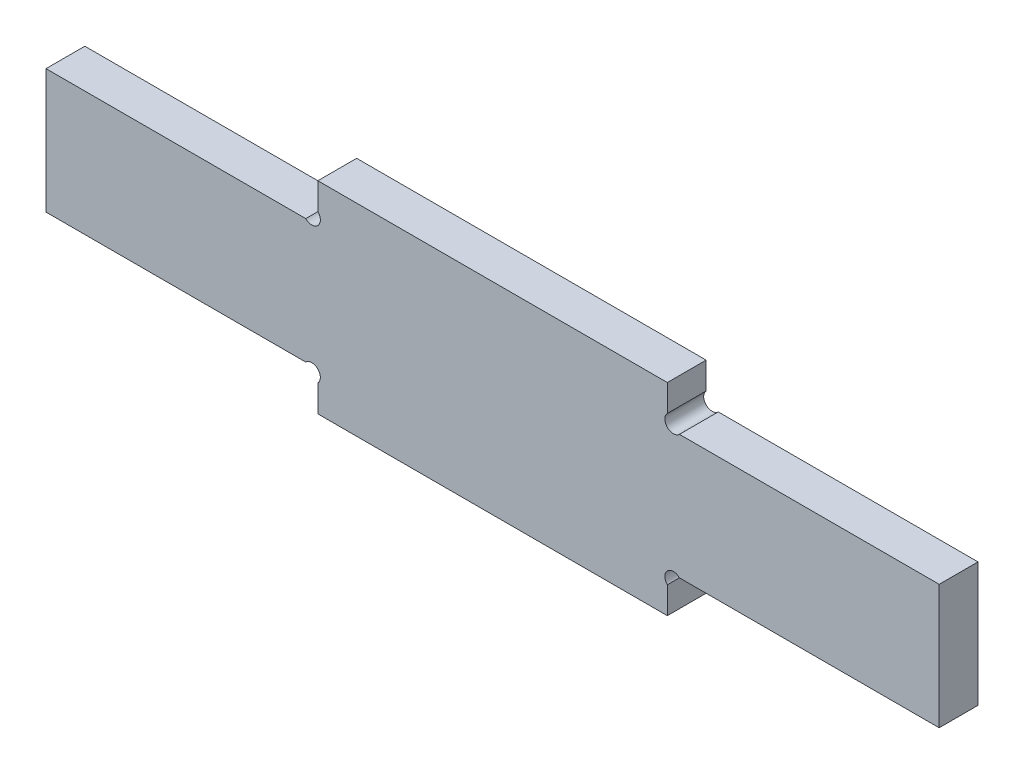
from build123d import *

# Parameters (mm, degrees)
ESQUISSE1_W             = 57.5
ESQUISSE1_H             = 26
BOSS_EXTRU_1_DEPTH      = 5
ENL_V_MAT_EXTRU_1_REACH = 65.303
ESQUISSE3_W             = 35
ESQUISSE3_H             = 5
ENL_V_START             = -5
ESQUISSE4_R             = 1.1
ENL_V_MAT_EXTRU_2_DEPTH = 5


with BuildPart() as part:
    # Esquisse1 → Boss.-Extru.1 (new body)
    with BuildSketch(Plane.XY):
        with Locations((28.75, 13)):
            Rectangle(ESQUISSE1_W, ESQUISSE1_H)
    boss_extru_1 = extrude(amount=BOSS_EXTRU_1_DEPTH)

    # Esquisse3 → Enl_v. mat.-Extru.1 (cut, up to next)
    with BuildSketch(Plane.XY.offset(5), mode=Mode.PRIVATE) as enl_v_mat_extru_1_sk1:
        with Locations((17.5, 23.5)):
            Rectangle(ESQUISSE3_W, ESQUISSE3_H)
    enl_v_mat_extru_1_tool1 = extrude(enl_v_mat_extru_1_sk1.sketch, amount=-ENL_V_MAT_EXTRU_1_REACH, mode=Mode.PRIVATE) & part.part
    # Esquisse3 → Enl_v. mat.-Extru.1 (cut, up to next)
    with BuildSketch(Plane.XY.offset(5), mode=Mode.PRIVATE) as enl_v_mat_extru_1_sk2:
        with Locations((17.5, 2.5)):
            Rectangle(ESQUISSE3_W, ESQUISSE3_H)
    enl_v_mat_extru_1_tool2 = extrude(enl_v_mat_extru_1_sk2.sketch, amount=-ENL_V_MAT_EXTRU_1_REACH, mode=Mode.PRIVATE) & part.part
    enl_v_mat_extru_1_1 = enl_v_mat_extru_1_tool1.solids().sort_by_distance((17.5, 23.5, 5))[0]
    add(enl_v_mat_extru_1_1, mode=Mode.SUBTRACT)
    enl_v_mat_extru_1_2 = enl_v_mat_extru_1_tool2.solids().sort_by_distance((17.5, 2.5, 5))[0]
    add(enl_v_mat_extru_1_2, mode=Mode.SUBTRACT)
    enl_v_mat_extru_1 = enl_v_mat_extru_1_1 + enl_v_mat_extru_1_2  # Enl_v. mat.-Extru.1 as one shape, for the pattern or mirror that repeats it

    # Esquisse4 → Enl_v. mat.-Extru.2 (cut)
    with BuildSketch(Plane.XY.offset(5).offset(ENL_V_START)):
        with Locations((34.222182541, 21.777817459)):
            Circle(ESQUISSE4_R)
        with Locations((34.222182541, 4.222182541)):
            Circle(ESQUISSE4_R)
    enl_v_mat_extru_2 = extrude(amount=ENL_V_MAT_EXTRU_2_DEPTH, mode=Mode.SUBTRACT)

    # Sym_trie1: Boss.-Extru.1, Enl_v. mat.-Extru.1, Enl_v. mat.-Extru.2 across plane
    add(boss_extru_1.mirror(Plane(origin=(57.5, 0, 5), x_dir=(0, 0, 1), z_dir=(-1, 0, 0))))
    add(enl_v_mat_extru_1.mirror(Plane(origin=(57.5, 0, 5), x_dir=(0, 0, 1), z_dir=(-1, 0, 0))), mode=Mode.SUBTRACT)
    add(enl_v_mat_extru_2.mirror(Plane(origin=(57.5, 0, 5), x_dir=(0, 0, 1), z_dir=(-1, 0, 0))), mode=Mode.SUBTRACT)


solid = part.part
